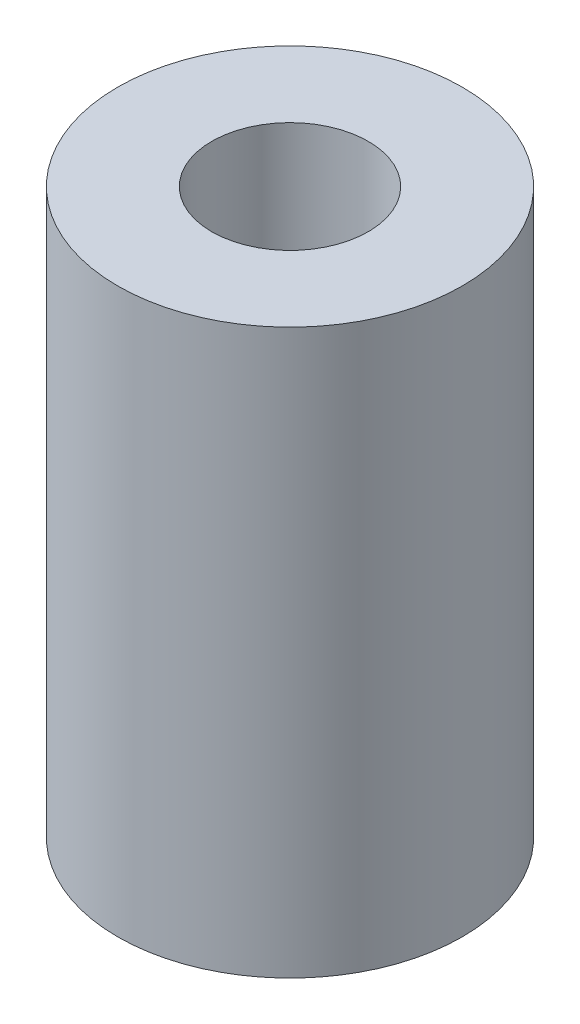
from build123d import *

# Parameters (mm, degrees)
SKETCH1_R           = 5.5
SKETCH1_R_2         = 2.5
BOSS_EXTRUDE1_DEPTH = 18


with BuildPart() as part:
    # Sketch1 → Boss-Extrude1 (new body)
    with BuildSketch(Plane(origin=(0, 0, 0), x_dir=(1, 0, 0), z_dir=(0, 1, 0))):
        with Locations(Location((0, 0, 0), (0, 0, 270))):
            Circle(SKETCH1_R)
        with Locations(Location((0, 0, 0), (0, 0, 270))):
            Circle(SKETCH1_R_2, mode=Mode.SUBTRACT)
    extrude(amount=BOSS_EXTRUDE1_DEPTH)


solid = part.part
